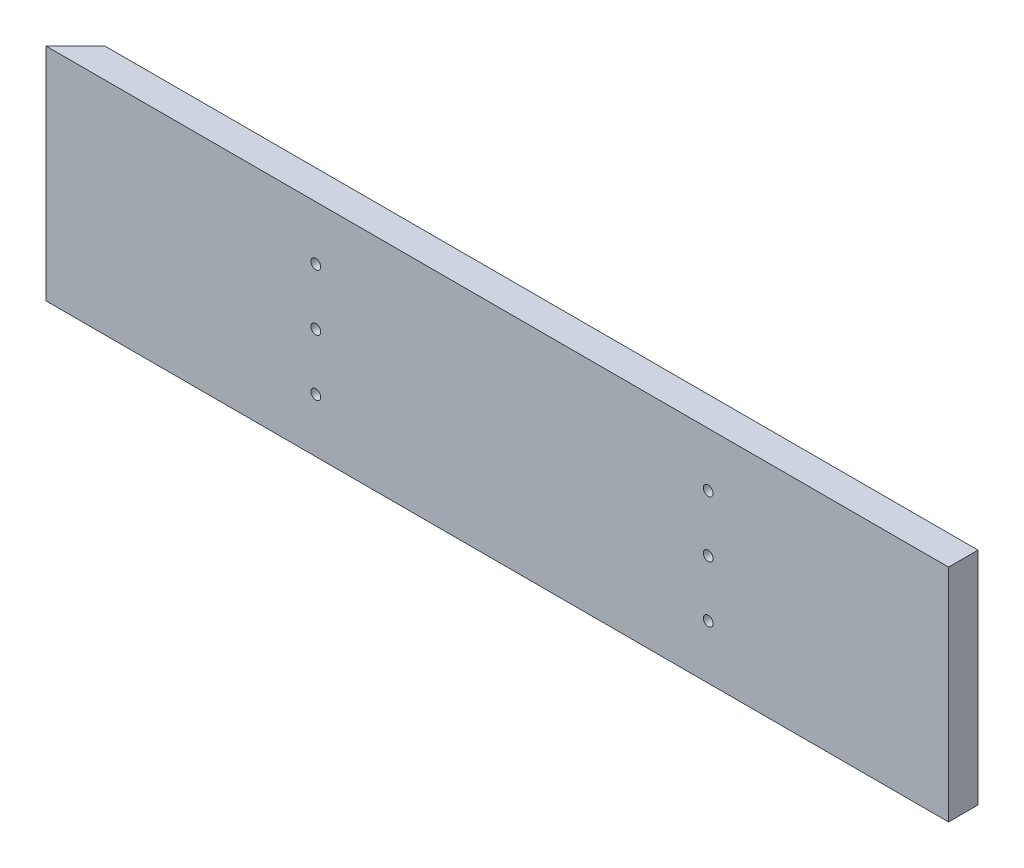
from build123d import *

# Parameters (mm, degrees)
SKETCH2_W           = 38.1
SKETCH2_H           = 285.75
BOSS_EXTRUDE1_DEPTH = 1168.4
SKETCH3_R           = 6.35
CUT_EXTRUDE1_DEPTH  = 1204.438088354
CUT_EXTRUDE2_DEPTH  = 1204.438088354


with BuildPart() as part:
    # Sketch2 → Boss-Extrude1 (new body)
    with BuildSketch(Plane(origin=(0, 0, 0), x_dir=(0, 0, -1), z_dir=(1, 0, 0))):
        with Locations((19.05, 142.875)):
            Rectangle(SKETCH2_W, SKETCH2_H)
    extrude(amount=BOSS_EXTRUDE1_DEPTH)

    # Sketch3 → Cut-Extrude1 (cut, through all)
    with BuildSketch(Plane.XY):
        with Locations((349.25, 142.875)):
            Circle(SKETCH3_R)
        with Locations((857.25, 142.875)):
            Circle(SKETCH3_R)
        with Locations((349.25, 69.85)):
            Circle(SKETCH3_R)
        with Locations((857.25, 69.85)):
            Circle(SKETCH3_R)
        with Locations((349.25, 215.9)):
            Circle(SKETCH3_R)
        with Locations((857.25, 215.9)):
            Circle(SKETCH3_R)
    extrude(amount=-CUT_EXTRUDE1_DEPTH, mode=Mode.SUBTRACT)

    # Sketch4 → Cut-Extrude2 (cut, through all)
    with BuildSketch(Plane(origin=(0, 285.75, 0), x_dir=(1, 0, 0), z_dir=(0, 1, 0))):
        Polygon((0, 0), (38.1, 38.1), (0, 38.1), align=None)
    extrude(amount=-CUT_EXTRUDE2_DEPTH, mode=Mode.SUBTRACT)


solid = part.part
